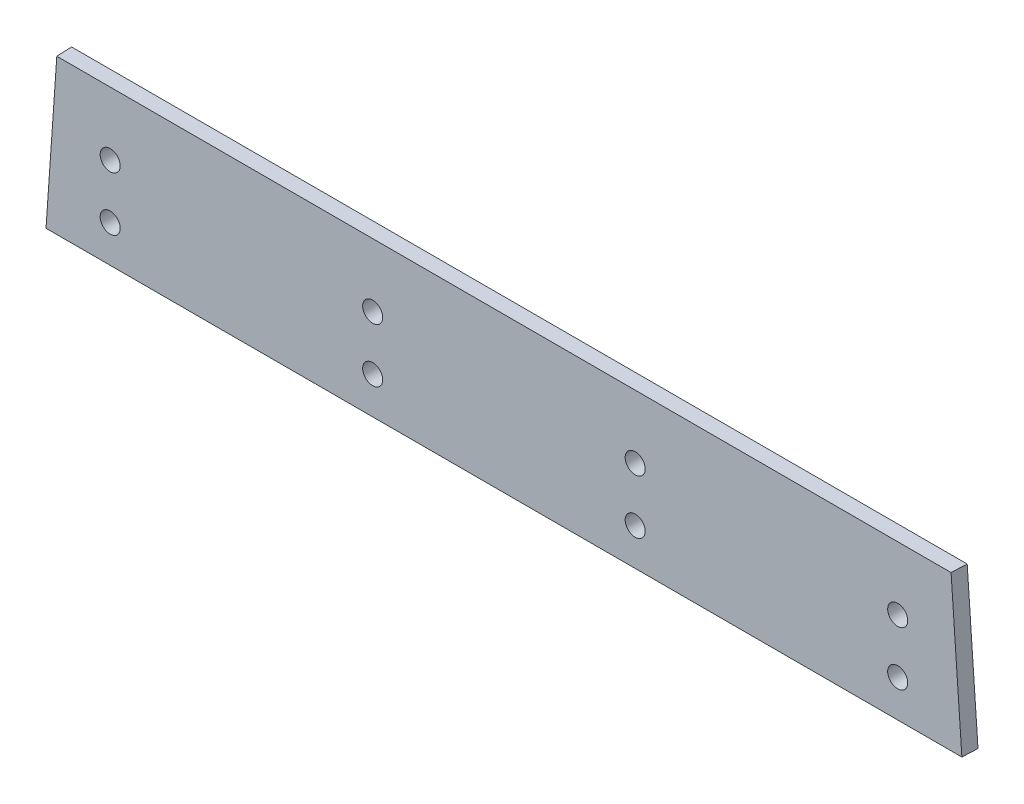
ISO-10303-21;
HEADER;
FILE_DESCRIPTION(('STEP AP214'),'2;1');
FILE_NAME('part.step','',(''),(''),'','','');
FILE_SCHEMA(('AUTOMOTIVE_DESIGN { 1 0 10303 214 1 1 1 1 }'));
ENDSEC;
DATA;
#1=APPLICATION_CONTEXT('core data for automotive mechanical design processes');
#2=APPLICATION_PROTOCOL_DEFINITION('international standard','automotive_design',2000,#1);
#3=PRODUCT_CONTEXT('',#1,'mechanical');
#4=PRODUCT('Part','Part','',(#3));
#5=PRODUCT_RELATED_PRODUCT_CATEGORY('part','',(#4));
#6=PRODUCT_DEFINITION_FORMATION('','',#4);
#7=PRODUCT_DEFINITION_CONTEXT('part definition',#1,'design');
#8=PRODUCT_DEFINITION('design','',#6,#7);
#9=PRODUCT_DEFINITION_SHAPE('','',#8);
#10=(LENGTH_UNIT() NAMED_UNIT(*) SI_UNIT(.MILLI.,.METRE.));
#11=(NAMED_UNIT(*) PLANE_ANGLE_UNIT() SI_UNIT($,.RADIAN.));
#12=(NAMED_UNIT(*) SI_UNIT($,.STERADIAN.) SOLID_ANGLE_UNIT());
#13=UNCERTAINTY_MEASURE_WITH_UNIT(LENGTH_MEASURE(1.E-05),#10,'distance_accuracy_value','');
#14=(GEOMETRIC_REPRESENTATION_CONTEXT(3) GLOBAL_UNCERTAINTY_ASSIGNED_CONTEXT((#13)) GLOBAL_UNIT_ASSIGNED_CONTEXT((#10,
#11,#12)) REPRESENTATION_CONTEXT('',''));
#15=CARTESIAN_POINT('',(0.,0.,0.));
#16=DIRECTION('',(0.,0.,1.));
#17=DIRECTION('',(1.,0.,0.));
#18=AXIS2_PLACEMENT_3D('',#15,#16,#17);
#19=CARTESIAN_POINT('',(297.,-100.,10.));
#20=DIRECTION('',(0.,1.,0.));
#21=DIRECTION('',(-1.,0.,0.));
#22=AXIS2_PLACEMENT_3D('',#19,#20,#21);
#23=PLANE('',#22);
#24=DIRECTION('',(1.,0.,0.));
#25=VECTOR('',#24,1.);
#26=CARTESIAN_POINT('',(297.,-100.,10.));
#27=LINE('',#26,#25);
#28=CARTESIAN_POINT('',(-296.562322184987,-100.,10.));
#29=VERTEX_POINT('',#28);
#30=CARTESIAN_POINT('',(296.562322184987,-100.,10.));
#31=VERTEX_POINT('',#30);
#32=EDGE_CURVE('E82',#29,#31,#27,.T.);
#33=ORIENTED_EDGE('',*,*,#32,.F.);
#34=DIRECTION('',(0.0437259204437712,0.,0.999043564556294));
#35=VECTOR('',#34,1.);
#36=CARTESIAN_POINT('',(-296.548942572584,-100.,10.305695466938));
#37=LINE('',#36,#35);
#38=CARTESIAN_POINT('',(-297.,-100.,0.));
#39=VERTEX_POINT('',#38);
#40=EDGE_CURVE('E47',#29,#39,#37,.F.);
#41=ORIENTED_EDGE('',*,*,#40,.T.);
#42=DIRECTION('',(1.,0.,0.));
#43=VECTOR('',#42,1.);
#44=CARTESIAN_POINT('',(297.,-100.,0.));
#45=LINE('',#44,#43);
#46=CARTESIAN_POINT('',(297.,-100.,0.));
#47=VERTEX_POINT('',#46);
#48=EDGE_CURVE('E80',#39,#47,#45,.T.);
#49=ORIENTED_EDGE('',*,*,#48,.T.);
#50=DIRECTION('',(0.0437259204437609,0.,-0.999043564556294));
#51=VECTOR('',#50,1.);
#52=CARTESIAN_POINT('',(296.543535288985,-100.,10.4292403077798));
#53=LINE('',#52,#51);
#54=EDGE_CURVE('E137',#47,#31,#53,.F.);
#55=ORIENTED_EDGE('',*,*,#54,.T.);
#56=EDGE_LOOP('',(#33,#41,#49,#55));
#57=FACE_BOUND('',#56,.T.);
#58=ADVANCED_FACE('F39',(#57),#23,.F.);
#59=CARTESIAN_POINT('',(-290.,0.,10.));
#60=DIRECTION('',(0.,-1.,0.));
#61=DIRECTION('',(0.,0.,-1.));
#62=AXIS2_PLACEMENT_3D('',#59,#60,#61);
#63=PLANE('',#62);
#64=DIRECTION('',(-1.,0.,0.));
#65=VECTOR('',#64,1.);
#66=CARTESIAN_POINT('',(-290.,0.,0.));
#67=LINE('',#66,#65);
#68=CARTESIAN_POINT('',(290.,0.,0.));
#69=VERTEX_POINT('',#68);
#70=CARTESIAN_POINT('',(-290.,0.,0.));
#71=VERTEX_POINT('',#70);
#72=EDGE_CURVE('E103',#69,#71,#67,.T.);
#73=ORIENTED_EDGE('',*,*,#72,.T.);
#74=DIRECTION('',(-0.0437259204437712,0.,-0.999043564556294));
#75=VECTOR('',#74,1.);
#76=CARTESIAN_POINT('',(-289.562326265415,0.,9.99990677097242));
#77=LINE('',#76,#75);
#78=CARTESIAN_POINT('',(-289.562322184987,0.,10.));
#79=VERTEX_POINT('',#78);
#80=EDGE_CURVE('E11',#71,#79,#77,.F.);
#81=ORIENTED_EDGE('',*,*,#80,.T.);
#82=DIRECTION('',(-1.,0.,0.));
#83=VECTOR('',#82,1.);
#84=CARTESIAN_POINT('',(-290.,0.,10.));
#85=LINE('',#84,#83);
#86=CARTESIAN_POINT('',(289.562322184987,0.,10.));
#87=VERTEX_POINT('',#86);
#88=EDGE_CURVE('E106',#87,#79,#85,.T.);
#89=ORIENTED_EDGE('',*,*,#88,.F.);
#90=DIRECTION('',(-0.0437259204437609,0.,0.999043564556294));
#91=VECTOR('',#90,1.);
#92=CARTESIAN_POINT('',(289.556918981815,0.,10.1234516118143));
#93=LINE('',#92,#91);
#94=EDGE_CURVE('E135',#87,#69,#93,.F.);
#95=ORIENTED_EDGE('',*,*,#94,.T.);
#96=EDGE_LOOP('',(#73,#81,#89,#95));
#97=FACE_BOUND('',#96,.T.);
#98=ADVANCED_FACE('F143',(#97),#63,.F.);
#99=CARTESIAN_POINT('',(-290.,0.,10.));
#100=DIRECTION('',(0.,0.,-1.));
#101=DIRECTION('',(-1.,0.,0.));
#102=AXIS2_PLACEMENT_3D('',#99,#100,#101);
#103=PLANE('',#102);
#104=CARTESIAN_POINT('',(-85.,-41.0000000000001,10.));
#105=DIRECTION('',(0.,0.,1.));
#106=DIRECTION('',(1.,0.,0.));
#107=AXIS2_PLACEMENT_3D('',#104,#105,#106);
#108=CIRCLE('',#107,6.50000000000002);
#109=CARTESIAN_POINT('',(-78.5,-41.0000000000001,10.));
#110=VERTEX_POINT('',#109);
#111=EDGE_CURVE('E220',#110,#110,#108,.T.);
#112=ORIENTED_EDGE('',*,*,#111,.F.);
#113=EDGE_LOOP('',(#112));
#114=FACE_BOUND('',#113,.T.);
#115=CARTESIAN_POINT('',(-85.,-76.0000000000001,10.));
#116=DIRECTION('',(0.,0.,1.));
#117=DIRECTION('',(1.,0.,0.));
#118=AXIS2_PLACEMENT_3D('',#115,#116,#117);
#119=CIRCLE('',#118,6.50000000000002);
#120=CARTESIAN_POINT('',(-78.5,-76.0000000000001,10.));
#121=VERTEX_POINT('',#120);
#122=EDGE_CURVE('E214',#121,#121,#119,.T.);
#123=ORIENTED_EDGE('',*,*,#122,.F.);
#124=EDGE_LOOP('',(#123));
#125=FACE_BOUND('',#124,.T.);
#126=CARTESIAN_POINT('',(-255.,-76.0000000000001,10.));
#127=DIRECTION('',(0.,0.,1.));
#128=DIRECTION('',(1.,0.,0.));
#129=AXIS2_PLACEMENT_3D('',#126,#127,#128);
#130=CIRCLE('',#129,6.50000000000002);
#131=CARTESIAN_POINT('',(-248.5,-76.0000000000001,10.));
#132=VERTEX_POINT('',#131);
#133=EDGE_CURVE('E215',#132,#132,#130,.T.);
#134=ORIENTED_EDGE('',*,*,#133,.F.);
#135=EDGE_LOOP('',(#134));
#136=FACE_BOUND('',#135,.T.);
#137=CARTESIAN_POINT('',(-255.,-41.0000000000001,10.));
#138=DIRECTION('',(0.,0.,1.));
#139=DIRECTION('',(1.,0.,0.));
#140=AXIS2_PLACEMENT_3D('',#137,#138,#139);
#141=CIRCLE('',#140,6.50000000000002);
#142=CARTESIAN_POINT('',(-248.5,-41.0000000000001,10.));
#143=VERTEX_POINT('',#142);
#144=EDGE_CURVE('E98',#143,#143,#141,.T.);
#145=ORIENTED_EDGE('',*,*,#144,.F.);
#146=EDGE_LOOP('',(#145));
#147=FACE_BOUND('',#146,.T.);
#148=ORIENTED_EDGE('',*,*,#88,.T.);
#149=DIRECTION('',(-0.0698291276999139,-0.997558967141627,0.));
#150=VECTOR('',#149,1.);
#151=CARTESIAN_POINT('',(-289.564456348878,-0.0304880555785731,10.));
#152=LINE('',#151,#150);
#153=EDGE_CURVE('E83',#79,#29,#152,.T.);
#154=ORIENTED_EDGE('',*,*,#153,.T.);
#155=ORIENTED_EDGE('',*,*,#32,.T.);
#156=DIRECTION('',(-0.0698291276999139,0.997558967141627,0.));
#157=VECTOR('',#156,1.);
#158=CARTESIAN_POINT('',(286.736314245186,40.371541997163,10.));
#159=LINE('',#158,#157);
#160=EDGE_CURVE('E132',#31,#87,#159,.T.);
#161=ORIENTED_EDGE('',*,*,#160,.T.);
#162=EDGE_LOOP('',(#148,#154,#155,#161));
#163=FACE_BOUND('',#162,.T.);
#164=CARTESIAN_POINT('',(85.,-76.0000000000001,10.));
#165=DIRECTION('',(0.,0.,1.));
#166=DIRECTION('',(1.,0.,0.));
#167=AXIS2_PLACEMENT_3D('',#164,#165,#166);
#168=CIRCLE('',#167,6.50000000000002);
#169=CARTESIAN_POINT('',(91.5,-76.0000000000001,10.));
#170=VERTEX_POINT('',#169);
#171=EDGE_CURVE('E111',#170,#170,#168,.T.);
#172=ORIENTED_EDGE('',*,*,#171,.F.);
#173=EDGE_LOOP('',(#172));
#174=FACE_BOUND('',#173,.T.);
#175=CARTESIAN_POINT('',(255.,-76.0000000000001,10.));
#176=DIRECTION('',(0.,0.,1.));
#177=DIRECTION('',(1.,0.,0.));
#178=AXIS2_PLACEMENT_3D('',#175,#176,#177);
#179=CIRCLE('',#178,6.50000000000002);
#180=CARTESIAN_POINT('',(261.5,-76.0000000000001,10.));
#181=VERTEX_POINT('',#180);
#182=EDGE_CURVE('E117',#181,#181,#179,.T.);
#183=ORIENTED_EDGE('',*,*,#182,.F.);
#184=EDGE_LOOP('',(#183));
#185=FACE_BOUND('',#184,.T.);
#186=CARTESIAN_POINT('',(85.,-41.0000000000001,10.));
#187=DIRECTION('',(0.,0.,1.));
#188=DIRECTION('',(1.,0.,0.));
#189=AXIS2_PLACEMENT_3D('',#186,#187,#188);
#190=CIRCLE('',#189,6.50000000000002);
#191=CARTESIAN_POINT('',(91.5,-41.0000000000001,10.));
#192=VERTEX_POINT('',#191);
#193=EDGE_CURVE('E123',#192,#192,#190,.T.);
#194=ORIENTED_EDGE('',*,*,#193,.F.);
#195=EDGE_LOOP('',(#194));
#196=FACE_BOUND('',#195,.T.);
#197=CARTESIAN_POINT('',(255.,-41.0000000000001,10.));
#198=DIRECTION('',(0.,0.,1.));
#199=DIRECTION('',(1.,0.,0.));
#200=AXIS2_PLACEMENT_3D('',#197,#198,#199);
#201=CIRCLE('',#200,6.50000000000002);
#202=CARTESIAN_POINT('',(261.5,-41.0000000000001,10.));
#203=VERTEX_POINT('',#202);
#204=EDGE_CURVE('E129',#203,#203,#201,.T.);
#205=ORIENTED_EDGE('',*,*,#204,.F.);
#206=EDGE_LOOP('',(#205));
#207=FACE_BOUND('',#206,.T.);
#208=ADVANCED_FACE('F140',(#114,#125,#136,#147,#163,#174,#185,#196,#207),#103,.F.);
#209=CARTESIAN_POINT('',(-290.,0.,0.));
#210=DIRECTION('',(0.,0.,-1.));
#211=DIRECTION('',(-1.,0.,0.));
#212=AXIS2_PLACEMENT_3D('',#209,#210,#211);
#213=PLANE('',#212);
#214=CARTESIAN_POINT('',(-85.,-41.0000000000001,0.));
#215=DIRECTION('',(0.,0.,1.));
#216=DIRECTION('',(1.,0.,0.));
#217=AXIS2_PLACEMENT_3D('',#214,#215,#216);
#218=CIRCLE('',#217,6.50000000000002);
#219=CARTESIAN_POINT('',(-78.5,-41.0000000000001,0.));
#220=VERTEX_POINT('',#219);
#221=EDGE_CURVE('E238',#220,#220,#218,.T.);
#222=ORIENTED_EDGE('',*,*,#221,.T.);
#223=EDGE_LOOP('',(#222));
#224=FACE_BOUND('',#223,.T.);
#225=CARTESIAN_POINT('',(-85.,-76.0000000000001,0.));
#226=DIRECTION('',(0.,0.,1.));
#227=DIRECTION('',(1.,0.,0.));
#228=AXIS2_PLACEMENT_3D('',#225,#226,#227);
#229=CIRCLE('',#228,6.50000000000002);
#230=CARTESIAN_POINT('',(-78.5,-76.0000000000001,0.));
#231=VERTEX_POINT('',#230);
#232=EDGE_CURVE('E211',#231,#231,#229,.T.);
#233=ORIENTED_EDGE('',*,*,#232,.T.);
#234=EDGE_LOOP('',(#233));
#235=FACE_BOUND('',#234,.T.);
#236=CARTESIAN_POINT('',(-255.,-76.0000000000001,0.));
#237=DIRECTION('',(0.,0.,1.));
#238=DIRECTION('',(1.,0.,0.));
#239=AXIS2_PLACEMENT_3D('',#236,#237,#238);
#240=CIRCLE('',#239,6.50000000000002);
#241=CARTESIAN_POINT('',(-248.5,-76.0000000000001,0.));
#242=VERTEX_POINT('',#241);
#243=EDGE_CURVE('E218',#242,#242,#240,.T.);
#244=ORIENTED_EDGE('',*,*,#243,.T.);
#245=EDGE_LOOP('',(#244));
#246=FACE_BOUND('',#245,.T.);
#247=CARTESIAN_POINT('',(-255.,-41.0000000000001,0.));
#248=DIRECTION('',(0.,0.,1.));
#249=DIRECTION('',(1.,0.,0.));
#250=AXIS2_PLACEMENT_3D('',#247,#248,#249);
#251=CIRCLE('',#250,6.50000000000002);
#252=CARTESIAN_POINT('',(-248.5,-41.0000000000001,0.));
#253=VERTEX_POINT('',#252);
#254=EDGE_CURVE('E95',#253,#253,#251,.T.);
#255=ORIENTED_EDGE('',*,*,#254,.T.);
#256=EDGE_LOOP('',(#255));
#257=FACE_BOUND('',#256,.T.);
#258=DIRECTION('',(-0.0698291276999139,-0.997558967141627,0.));
#259=VECTOR('',#258,1.);
#260=CARTESIAN_POINT('',(-297.,-100.,0.));
#261=LINE('',#260,#259);
#262=EDGE_CURVE('E89',#71,#39,#261,.T.);
#263=ORIENTED_EDGE('',*,*,#262,.F.);
#264=ORIENTED_EDGE('',*,*,#72,.F.);
#265=DIRECTION('',(-0.0698291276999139,0.997558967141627,0.));
#266=VECTOR('',#265,1.);
#267=CARTESIAN_POINT('',(290.,0.,0.));
#268=LINE('',#267,#266);
#269=EDGE_CURVE('E91',#47,#69,#268,.T.);
#270=ORIENTED_EDGE('',*,*,#269,.F.);
#271=ORIENTED_EDGE('',*,*,#48,.F.);
#272=EDGE_LOOP('',(#263,#264,#270,#271));
#273=FACE_BOUND('',#272,.T.);
#274=CARTESIAN_POINT('',(85.,-76.0000000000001,0.));
#275=DIRECTION('',(0.,0.,1.));
#276=DIRECTION('',(1.,0.,0.));
#277=AXIS2_PLACEMENT_3D('',#274,#275,#276);
#278=CIRCLE('',#277,6.50000000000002);
#279=CARTESIAN_POINT('',(91.5,-76.0000000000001,0.));
#280=VERTEX_POINT('',#279);
#281=EDGE_CURVE('E108',#280,#280,#278,.T.);
#282=ORIENTED_EDGE('',*,*,#281,.T.);
#283=EDGE_LOOP('',(#282));
#284=FACE_BOUND('',#283,.T.);
#285=CARTESIAN_POINT('',(255.,-76.0000000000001,0.));
#286=DIRECTION('',(0.,0.,1.));
#287=DIRECTION('',(1.,0.,0.));
#288=AXIS2_PLACEMENT_3D('',#285,#286,#287);
#289=CIRCLE('',#288,6.50000000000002);
#290=CARTESIAN_POINT('',(261.5,-76.0000000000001,0.));
#291=VERTEX_POINT('',#290);
#292=EDGE_CURVE('E114',#291,#291,#289,.T.);
#293=ORIENTED_EDGE('',*,*,#292,.T.);
#294=EDGE_LOOP('',(#293));
#295=FACE_BOUND('',#294,.T.);
#296=CARTESIAN_POINT('',(85.,-41.0000000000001,0.));
#297=DIRECTION('',(0.,0.,1.));
#298=DIRECTION('',(1.,0.,0.));
#299=AXIS2_PLACEMENT_3D('',#296,#297,#298);
#300=CIRCLE('',#299,6.50000000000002);
#301=CARTESIAN_POINT('',(91.5,-41.0000000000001,0.));
#302=VERTEX_POINT('',#301);
#303=EDGE_CURVE('E120',#302,#302,#300,.T.);
#304=ORIENTED_EDGE('',*,*,#303,.T.);
#305=EDGE_LOOP('',(#304));
#306=FACE_BOUND('',#305,.T.);
#307=CARTESIAN_POINT('',(255.,-41.0000000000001,0.));
#308=DIRECTION('',(0.,0.,1.));
#309=DIRECTION('',(1.,0.,0.));
#310=AXIS2_PLACEMENT_3D('',#307,#308,#309);
#311=CIRCLE('',#310,6.50000000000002);
#312=CARTESIAN_POINT('',(261.5,-41.0000000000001,0.));
#313=VERTEX_POINT('',#312);
#314=EDGE_CURVE('E126',#313,#313,#311,.T.);
#315=ORIENTED_EDGE('',*,*,#314,.T.);
#316=EDGE_LOOP('',(#315));
#317=FACE_BOUND('',#316,.T.);
#318=ADVANCED_FACE('F86',(#224,#235,#246,#257,#273,#284,#295,#306,#317),#213,.T.);
#319=CARTESIAN_POINT('',(-255.,-41.0000000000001,0.));
#320=DIRECTION('',(0.,0.,1.));
#321=DIRECTION('',(1.,0.,0.));
#322=AXIS2_PLACEMENT_3D('',#319,#320,#321);
#323=CYLINDRICAL_SURFACE('',#322,6.50000000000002);
#324=ORIENTED_EDGE('',*,*,#254,.F.);
#325=EDGE_LOOP('',(#324));
#326=FACE_BOUND('',#325,.T.);
#327=ORIENTED_EDGE('',*,*,#144,.T.);
#328=EDGE_LOOP('',(#327));
#329=FACE_BOUND('',#328,.T.);
#330=ADVANCED_FACE('F191',(#326,#329),#323,.F.);
#331=CARTESIAN_POINT('',(-255.,-76.0000000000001,0.));
#332=DIRECTION('',(0.,0.,1.));
#333=DIRECTION('',(1.,0.,0.));
#334=AXIS2_PLACEMENT_3D('',#331,#332,#333);
#335=CYLINDRICAL_SURFACE('',#334,6.50000000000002);
#336=ORIENTED_EDGE('',*,*,#243,.F.);
#337=EDGE_LOOP('',(#336));
#338=FACE_BOUND('',#337,.T.);
#339=ORIENTED_EDGE('',*,*,#133,.T.);
#340=EDGE_LOOP('',(#339));
#341=FACE_BOUND('',#340,.T.);
#342=ADVANCED_FACE('F199',(#338,#341),#335,.F.);
#343=CARTESIAN_POINT('',(-85.,-76.0000000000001,0.));
#344=DIRECTION('',(0.,0.,1.));
#345=DIRECTION('',(1.,0.,0.));
#346=AXIS2_PLACEMENT_3D('',#343,#344,#345);
#347=CYLINDRICAL_SURFACE('',#346,6.50000000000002);
#348=ORIENTED_EDGE('',*,*,#232,.F.);
#349=EDGE_LOOP('',(#348));
#350=FACE_BOUND('',#349,.T.);
#351=ORIENTED_EDGE('',*,*,#122,.T.);
#352=EDGE_LOOP('',(#351));
#353=FACE_BOUND('',#352,.T.);
#354=ADVANCED_FACE('F168',(#350,#353),#347,.F.);
#355=CARTESIAN_POINT('',(85.,-76.0000000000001,0.));
#356=DIRECTION('',(0.,0.,1.));
#357=DIRECTION('',(1.,0.,0.));
#358=AXIS2_PLACEMENT_3D('',#355,#356,#357);
#359=CYLINDRICAL_SURFACE('',#358,6.50000000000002);
#360=ORIENTED_EDGE('',*,*,#281,.F.);
#361=EDGE_LOOP('',(#360));
#362=FACE_BOUND('',#361,.T.);
#363=ORIENTED_EDGE('',*,*,#171,.T.);
#364=EDGE_LOOP('',(#363));
#365=FACE_BOUND('',#364,.T.);
#366=ADVANCED_FACE('F164',(#362,#365),#359,.F.);
#367=CARTESIAN_POINT('',(255.,-76.0000000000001,0.));
#368=DIRECTION('',(0.,0.,1.));
#369=DIRECTION('',(1.,0.,0.));
#370=AXIS2_PLACEMENT_3D('',#367,#368,#369);
#371=CYLINDRICAL_SURFACE('',#370,6.50000000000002);
#372=ORIENTED_EDGE('',*,*,#292,.F.);
#373=EDGE_LOOP('',(#372));
#374=FACE_BOUND('',#373,.T.);
#375=ORIENTED_EDGE('',*,*,#182,.T.);
#376=EDGE_LOOP('',(#375));
#377=FACE_BOUND('',#376,.T.);
#378=ADVANCED_FACE('F167',(#374,#377),#371,.F.);
#379=CARTESIAN_POINT('',(-85.,-41.0000000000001,0.));
#380=DIRECTION('',(0.,0.,1.));
#381=DIRECTION('',(1.,0.,0.));
#382=AXIS2_PLACEMENT_3D('',#379,#380,#381);
#383=CYLINDRICAL_SURFACE('',#382,6.50000000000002);
#384=ORIENTED_EDGE('',*,*,#221,.F.);
#385=EDGE_LOOP('',(#384));
#386=FACE_BOUND('',#385,.T.);
#387=ORIENTED_EDGE('',*,*,#111,.T.);
#388=EDGE_LOOP('',(#387));
#389=FACE_BOUND('',#388,.T.);
#390=ADVANCED_FACE('F171',(#386,#389),#383,.F.);
#391=CARTESIAN_POINT('',(85.,-41.0000000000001,0.));
#392=DIRECTION('',(0.,0.,1.));
#393=DIRECTION('',(1.,0.,0.));
#394=AXIS2_PLACEMENT_3D('',#391,#392,#393);
#395=CYLINDRICAL_SURFACE('',#394,6.50000000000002);
#396=ORIENTED_EDGE('',*,*,#303,.F.);
#397=EDGE_LOOP('',(#396));
#398=FACE_BOUND('',#397,.T.);
#399=ORIENTED_EDGE('',*,*,#193,.T.);
#400=EDGE_LOOP('',(#399));
#401=FACE_BOUND('',#400,.T.);
#402=ADVANCED_FACE('F154',(#398,#401),#395,.F.);
#403=CARTESIAN_POINT('',(255.,-41.0000000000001,0.));
#404=DIRECTION('',(0.,0.,1.));
#405=DIRECTION('',(1.,0.,0.));
#406=AXIS2_PLACEMENT_3D('',#403,#404,#405);
#407=CYLINDRICAL_SURFACE('',#406,6.50000000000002);
#408=ORIENTED_EDGE('',*,*,#314,.F.);
#409=EDGE_LOOP('',(#408));
#410=FACE_BOUND('',#409,.T.);
#411=ORIENTED_EDGE('',*,*,#204,.T.);
#412=EDGE_LOOP('',(#411));
#413=FACE_BOUND('',#412,.T.);
#414=ADVANCED_FACE('F41',(#410,#413),#407,.F.);
#415=CARTESIAN_POINT('',(286.736314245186,40.371541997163,10.));
#416=DIRECTION('',(-0.996609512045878,-0.0697626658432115,-0.0436193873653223));
#417=DIRECTION('',(0.0698291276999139,-0.997558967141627,0.));
#418=AXIS2_PLACEMENT_3D('',#415,#416,#417);
#419=PLANE('',#418);
#420=ORIENTED_EDGE('',*,*,#54,.F.);
#421=ORIENTED_EDGE('',*,*,#269,.T.);
#422=ORIENTED_EDGE('',*,*,#94,.F.);
#423=ORIENTED_EDGE('',*,*,#160,.F.);
#424=EDGE_LOOP('',(#420,#421,#422,#423));
#425=FACE_BOUND('',#424,.T.);
#426=ADVANCED_FACE('F145',(#425),#419,.F.);
#427=CARTESIAN_POINT('',(-289.564456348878,-0.030488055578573,10.));
#428=DIRECTION('',(0.996609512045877,-0.0697626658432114,-0.0436193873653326));
#429=DIRECTION('',(0.0698291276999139,0.997558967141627,0.));
#430=AXIS2_PLACEMENT_3D('',#427,#428,#429);
#431=PLANE('',#430);
#432=ORIENTED_EDGE('',*,*,#80,.F.);
#433=ORIENTED_EDGE('',*,*,#262,.T.);
#434=ORIENTED_EDGE('',*,*,#40,.F.);
#435=ORIENTED_EDGE('',*,*,#153,.F.);
#436=EDGE_LOOP('',(#432,#433,#434,#435));
#437=FACE_BOUND('',#436,.T.);
#438=ADVANCED_FACE('F94',(#437),#431,.F.);
#439=CLOSED_SHELL('',(#58,#98,#208,#318,#330,#342,#354,#366,#378,#390,#402,#414,#426,#438));
#440=MANIFOLD_SOLID_BREP('B2',#439);
#441=ADVANCED_BREP_SHAPE_REPRESENTATION('',(#18,#440),#14);
#442=SHAPE_DEFINITION_REPRESENTATION(#9,#441);
ENDSEC;
END-ISO-10303-21;
